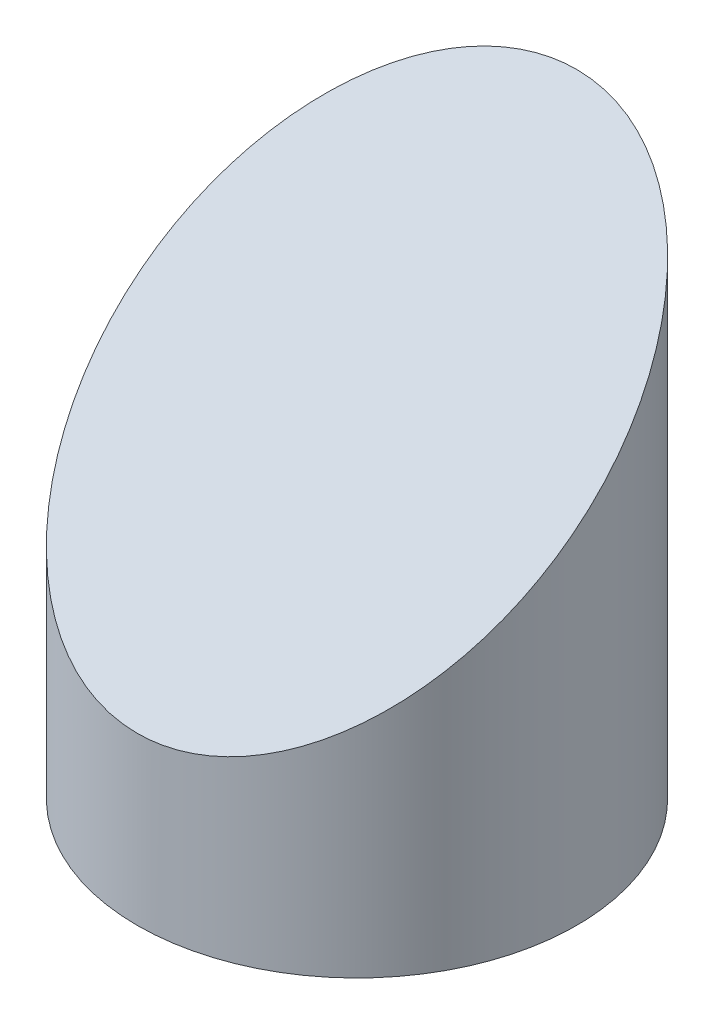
ISO-10303-21;
HEADER;
FILE_DESCRIPTION(('STEP AP214'),'2;1');
FILE_NAME('part.step','',(''),(''),'','','');
FILE_SCHEMA(('AUTOMOTIVE_DESIGN { 1 0 10303 214 1 1 1 1 }'));
ENDSEC;
DATA;
#1=APPLICATION_CONTEXT('core data for automotive mechanical design processes');
#2=APPLICATION_PROTOCOL_DEFINITION('international standard','automotive_design',2000,#1);
#3=PRODUCT_CONTEXT('',#1,'mechanical');
#4=PRODUCT('Part','Part','',(#3));
#5=PRODUCT_RELATED_PRODUCT_CATEGORY('part','',(#4));
#6=PRODUCT_DEFINITION_FORMATION('','',#4);
#7=PRODUCT_DEFINITION_CONTEXT('part definition',#1,'design');
#8=PRODUCT_DEFINITION('design','',#6,#7);
#9=PRODUCT_DEFINITION_SHAPE('','',#8);
#10=(LENGTH_UNIT() NAMED_UNIT(*) SI_UNIT(.MILLI.,.METRE.));
#11=(NAMED_UNIT(*) PLANE_ANGLE_UNIT() SI_UNIT($,.RADIAN.));
#12=(NAMED_UNIT(*) SI_UNIT($,.STERADIAN.) SOLID_ANGLE_UNIT());
#13=UNCERTAINTY_MEASURE_WITH_UNIT(LENGTH_MEASURE(1.E-05),#10,'distance_accuracy_value','');
#14=(GEOMETRIC_REPRESENTATION_CONTEXT(3) GLOBAL_UNCERTAINTY_ASSIGNED_CONTEXT((#13)) GLOBAL_UNIT_ASSIGNED_CONTEXT((#10,
#11,#12)) REPRESENTATION_CONTEXT('',''));
#15=CARTESIAN_POINT('',(0.,0.,0.));
#16=DIRECTION('',(0.,0.,1.));
#17=DIRECTION('',(1.,0.,0.));
#18=AXIS2_PLACEMENT_3D('',#15,#16,#17);
#19=CARTESIAN_POINT('',(0.,0.,0.));
#20=DIRECTION('',(0.,-1.,0.));
#21=DIRECTION('',(0.,0.,-1.));
#22=AXIS2_PLACEMENT_3D('',#19,#20,#21);
#23=PLANE('',#22);
#24=CARTESIAN_POINT('',(0.,0.,0.));
#25=DIRECTION('',(0.,-1.,0.));
#26=DIRECTION('',(0.,0.,-1.));
#27=AXIS2_PLACEMENT_3D('',#24,#25,#26);
#28=CIRCLE('',#27,25.);
#29=CARTESIAN_POINT('',(0.,0.,-25.));
#30=VERTEX_POINT('',#29);
#31=EDGE_CURVE('E48',#30,#30,#28,.T.);
#32=ORIENTED_EDGE('',*,*,#31,.T.);
#33=EDGE_LOOP('',(#32));
#34=FACE_BOUND('',#33,.T.);
#35=ADVANCED_FACE('F41',(#34),#23,.T.);
#36=CARTESIAN_POINT('',(0.,0.,0.));
#37=DIRECTION('',(0.,-1.,0.));
#38=DIRECTION('',(0.,0.,-1.));
#39=AXIS2_PLACEMENT_3D('',#36,#37,#38);
#40=CYLINDRICAL_SURFACE('',#39,25.);
#41=CARTESIAN_POINT('',(0.,39.1614274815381,0.));
#42=DIRECTION('',(0.,-0.777429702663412,-0.628969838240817));
#43=DIRECTION('',(0.,-0.628969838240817,0.777429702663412));
#44=AXIS2_PLACEMENT_3D('',#41,#42,#43);
#45=ELLIPSE('',#44,32.1572483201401,25.);
#46=CARTESIAN_POINT('',(0.,18.9354882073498,25.));
#47=VERTEX_POINT('',#46);
#48=EDGE_CURVE('E10',#47,#47,#45,.F.);
#49=ORIENTED_EDGE('',*,*,#48,.F.);
#50=EDGE_LOOP('',(#49));
#51=FACE_BOUND('',#50,.T.);
#52=ORIENTED_EDGE('',*,*,#31,.F.);
#53=EDGE_LOOP('',(#52));
#54=FACE_BOUND('',#53,.T.);
#55=ADVANCED_FACE('F56',(#51,#54),#40,.T.);
#56=CARTESIAN_POINT('',(-25.,59.3873667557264,-25.));
#57=DIRECTION('',(0.,-0.777429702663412,-0.628969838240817));
#58=DIRECTION('',(0.,0.628969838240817,-0.777429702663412));
#59=AXIS2_PLACEMENT_3D('',#56,#57,#58);
#60=PLANE('',#59);
#61=ORIENTED_EDGE('',*,*,#48,.T.);
#62=EDGE_LOOP('',(#61));
#63=FACE_BOUND('',#62,.T.);
#64=ADVANCED_FACE('F58',(#63),#60,.F.);
#65=CLOSED_SHELL('',(#35,#55,#64));
#66=MANIFOLD_SOLID_BREP('B2',#65);
#67=ADVANCED_BREP_SHAPE_REPRESENTATION('',(#18,#66),#14);
#68=SHAPE_DEFINITION_REPRESENTATION(#9,#67);
ENDSEC;
END-ISO-10303-21;
